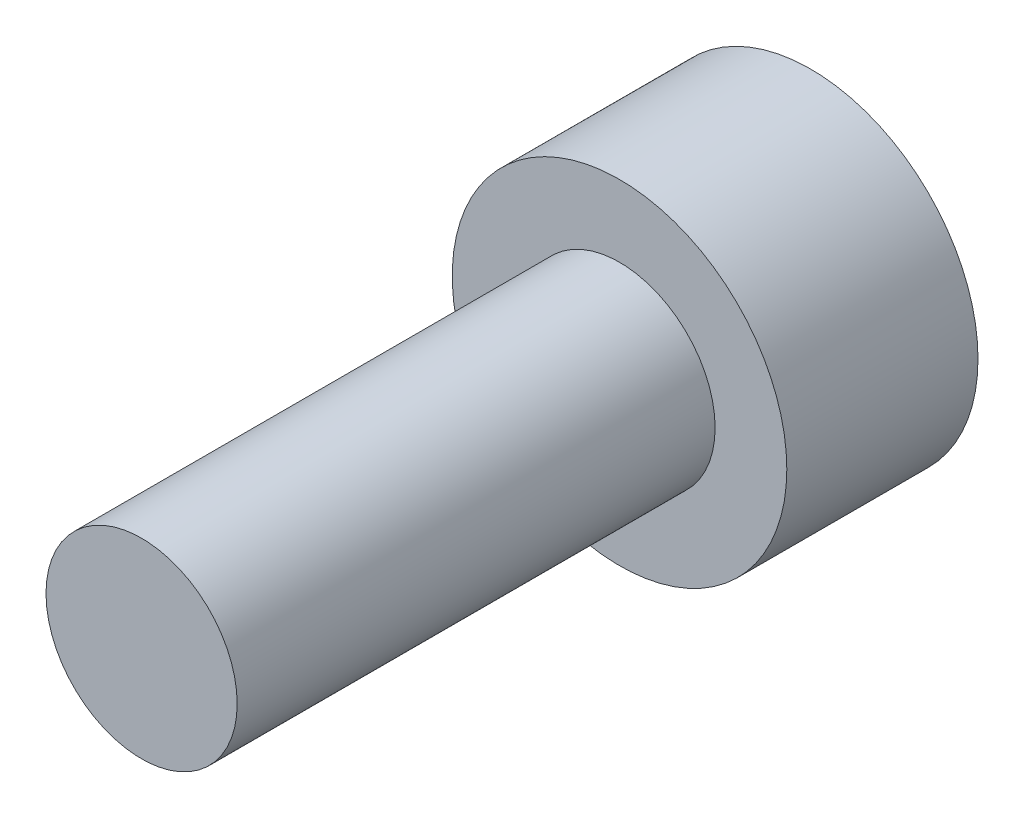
ISO-10303-21;
HEADER;
FILE_DESCRIPTION(('STEP AP214'),'2;1');
FILE_NAME('part.step','',(''),(''),'','','');
FILE_SCHEMA(('AUTOMOTIVE_DESIGN { 1 0 10303 214 1 1 1 1 }'));
ENDSEC;
DATA;
#1=APPLICATION_CONTEXT('core data for automotive mechanical design processes');
#2=APPLICATION_PROTOCOL_DEFINITION('international standard','automotive_design',2000,#1);
#3=PRODUCT_CONTEXT('',#1,'mechanical');
#4=PRODUCT('Part','Part','',(#3));
#5=PRODUCT_RELATED_PRODUCT_CATEGORY('part','',(#4));
#6=PRODUCT_DEFINITION_FORMATION('','',#4);
#7=PRODUCT_DEFINITION_CONTEXT('part definition',#1,'design');
#8=PRODUCT_DEFINITION('design','',#6,#7);
#9=PRODUCT_DEFINITION_SHAPE('','',#8);
#10=(LENGTH_UNIT() NAMED_UNIT(*) SI_UNIT(.MILLI.,.METRE.));
#11=(NAMED_UNIT(*) PLANE_ANGLE_UNIT() SI_UNIT($,.RADIAN.));
#12=(NAMED_UNIT(*) SI_UNIT($,.STERADIAN.) SOLID_ANGLE_UNIT());
#13=UNCERTAINTY_MEASURE_WITH_UNIT(LENGTH_MEASURE(1.E-05),#10,'distance_accuracy_value','');
#14=(GEOMETRIC_REPRESENTATION_CONTEXT(3) GLOBAL_UNCERTAINTY_ASSIGNED_CONTEXT((#13)) GLOBAL_UNIT_ASSIGNED_CONTEXT((#10,
#11,#12)) REPRESENTATION_CONTEXT('',''));
#15=CARTESIAN_POINT('',(0.,0.,0.));
#16=DIRECTION('',(0.,0.,1.));
#17=DIRECTION('',(1.,0.,0.));
#18=AXIS2_PLACEMENT_3D('',#15,#16,#17);
#19=CARTESIAN_POINT('',(0.,0.,10.));
#20=DIRECTION('',(0.,0.,1.));
#21=DIRECTION('',(1.,0.,0.));
#22=AXIS2_PLACEMENT_3D('',#19,#20,#21);
#23=PLANE('',#22);
#24=CARTESIAN_POINT('',(0.,0.,10.));
#25=DIRECTION('',(0.,0.,1.));
#26=DIRECTION('',(1.,0.,0.));
#27=AXIS2_PLACEMENT_3D('',#24,#25,#26);
#28=CIRCLE('',#27,2.);
#29=CARTESIAN_POINT('',(2.,0.,10.));
#30=VERTEX_POINT('',#29);
#31=EDGE_CURVE('E11',#30,#30,#28,.T.);
#32=ORIENTED_EDGE('',*,*,#31,.T.);
#33=EDGE_LOOP('',(#32));
#34=FACE_BOUND('',#33,.T.);
#35=ADVANCED_FACE('F32',(#34),#23,.T.);
#36=CARTESIAN_POINT('',(0.,0.,10.));
#37=DIRECTION('',(0.,0.,1.));
#38=DIRECTION('',(1.,0.,0.));
#39=AXIS2_PLACEMENT_3D('',#36,#37,#38);
#40=CYLINDRICAL_SURFACE('',#39,2.);
#41=CARTESIAN_POINT('',(0.,0.,0.));
#42=DIRECTION('',(0.,0.,1.));
#43=DIRECTION('',(1.,0.,0.));
#44=AXIS2_PLACEMENT_3D('',#41,#42,#43);
#45=CIRCLE('',#44,2.);
#46=CARTESIAN_POINT('',(2.,0.,0.));
#47=VERTEX_POINT('',#46);
#48=EDGE_CURVE('E39',#47,#47,#45,.T.);
#49=ORIENTED_EDGE('',*,*,#48,.T.);
#50=EDGE_LOOP('',(#49));
#51=FACE_BOUND('',#50,.T.);
#52=ORIENTED_EDGE('',*,*,#31,.F.);
#53=EDGE_LOOP('',(#52));
#54=FACE_BOUND('',#53,.T.);
#55=ADVANCED_FACE('F146',(#51,#54),#40,.T.);
#56=CARTESIAN_POINT('',(0.,-2.,0.));
#57=DIRECTION('',(0.,0.,1.));
#58=DIRECTION('',(1.,0.,0.));
#59=AXIS2_PLACEMENT_3D('',#56,#57,#58);
#60=PLANE('',#59);
#61=CARTESIAN_POINT('',(0.,0.,0.));
#62=DIRECTION('',(0.,0.,1.));
#63=DIRECTION('',(1.,0.,0.));
#64=AXIS2_PLACEMENT_3D('',#61,#62,#63);
#65=CIRCLE('',#64,3.5);
#66=CARTESIAN_POINT('',(3.5,0.,0.));
#67=VERTEX_POINT('',#66);
#68=EDGE_CURVE('E141',#67,#67,#65,.T.);
#69=ORIENTED_EDGE('',*,*,#68,.T.);
#70=EDGE_LOOP('',(#69));
#71=FACE_BOUND('',#70,.T.);
#72=ORIENTED_EDGE('',*,*,#48,.F.);
#73=EDGE_LOOP('',(#72));
#74=FACE_BOUND('',#73,.T.);
#75=ADVANCED_FACE('F149',(#71,#74),#60,.T.);
#76=CARTESIAN_POINT('',(0.,0.,10.));
#77=DIRECTION('',(0.,0.,1.));
#78=DIRECTION('',(1.,0.,0.));
#79=AXIS2_PLACEMENT_3D('',#76,#77,#78);
#80=CYLINDRICAL_SURFACE('',#79,3.5);
#81=CARTESIAN_POINT('',(0.,0.,-4.));
#82=DIRECTION('',(0.,0.,1.));
#83=DIRECTION('',(1.,0.,0.));
#84=AXIS2_PLACEMENT_3D('',#81,#82,#83);
#85=CIRCLE('',#84,3.5);
#86=CARTESIAN_POINT('',(3.5,0.,-4.));
#87=VERTEX_POINT('',#86);
#88=EDGE_CURVE('E133',#87,#87,#85,.T.);
#89=ORIENTED_EDGE('',*,*,#88,.T.);
#90=EDGE_LOOP('',(#89));
#91=FACE_BOUND('',#90,.T.);
#92=ORIENTED_EDGE('',*,*,#68,.F.);
#93=EDGE_LOOP('',(#92));
#94=FACE_BOUND('',#93,.T.);
#95=ADVANCED_FACE('F151',(#91,#94),#80,.T.);
#96=CARTESIAN_POINT('',(0.,-3.5,-4.));
#97=DIRECTION('',(0.,0.,-1.));
#98=DIRECTION('',(-1.,0.,0.));
#99=AXIS2_PLACEMENT_3D('',#96,#97,#98);
#100=PLANE('',#99);
#101=DIRECTION('',(0.866025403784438,-0.5,0.));
#102=VECTOR('',#101,1.);
#103=CARTESIAN_POINT('',(0.,1.73205080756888,-4.));
#104=LINE('',#103,#102);
#105=CARTESIAN_POINT('',(0.,1.73205080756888,-4.));
#106=VERTEX_POINT('',#105);
#107=CARTESIAN_POINT('',(1.5,0.866025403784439,-4.));
#108=VERTEX_POINT('',#107);
#109=EDGE_CURVE('E46',#106,#108,#104,.T.);
#110=ORIENTED_EDGE('',*,*,#109,.F.);
#111=DIRECTION('',(0.866025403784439,0.5,0.));
#112=VECTOR('',#111,1.);
#113=CARTESIAN_POINT('',(-1.5,0.866025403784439,-4.));
#114=LINE('',#113,#112);
#115=CARTESIAN_POINT('',(-1.5,0.866025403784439,-4.));
#116=VERTEX_POINT('',#115);
#117=EDGE_CURVE('E129',#116,#106,#114,.T.);
#118=ORIENTED_EDGE('',*,*,#117,.F.);
#119=DIRECTION('',(0.,1.,0.));
#120=VECTOR('',#119,1.);
#121=CARTESIAN_POINT('',(-1.5,-0.866025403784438,-4.));
#122=LINE('',#121,#120);
#123=CARTESIAN_POINT('',(-1.5,-0.866025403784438,-4.));
#124=VERTEX_POINT('',#123);
#125=EDGE_CURVE('E127',#124,#116,#122,.T.);
#126=ORIENTED_EDGE('',*,*,#125,.F.);
#127=DIRECTION('',(-0.866025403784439,0.5,0.));
#128=VECTOR('',#127,1.);
#129=CARTESIAN_POINT('',(0.,-1.73205080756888,-4.));
#130=LINE('',#129,#128);
#131=CARTESIAN_POINT('',(0.,-1.73205080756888,-4.));
#132=VERTEX_POINT('',#131);
#133=EDGE_CURVE('E94',#132,#124,#130,.T.);
#134=ORIENTED_EDGE('',*,*,#133,.F.);
#135=DIRECTION('',(-0.866025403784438,-0.5,0.));
#136=VECTOR('',#135,1.);
#137=CARTESIAN_POINT('',(1.5,-0.866025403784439,-4.));
#138=LINE('',#137,#136);
#139=CARTESIAN_POINT('',(1.5,-0.866025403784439,-4.));
#140=VERTEX_POINT('',#139);
#141=EDGE_CURVE('E123',#140,#132,#138,.T.);
#142=ORIENTED_EDGE('',*,*,#141,.F.);
#143=DIRECTION('',(0.,-1.,0.));
#144=VECTOR('',#143,1.);
#145=CARTESIAN_POINT('',(1.5,0.866025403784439,-4.));
#146=LINE('',#145,#144);
#147=EDGE_CURVE('E120',#108,#140,#146,.T.);
#148=ORIENTED_EDGE('',*,*,#147,.F.);
#149=EDGE_LOOP('',(#110,#118,#126,#134,#142,#148));
#150=FACE_BOUND('',#149,.T.);
#151=ORIENTED_EDGE('',*,*,#88,.F.);
#152=EDGE_LOOP('',(#151));
#153=FACE_BOUND('',#152,.T.);
#154=ADVANCED_FACE('F158',(#150,#153),#100,.T.);
#155=CARTESIAN_POINT('',(0.,1.73205080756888,-1.));
#156=DIRECTION('',(0.5,0.866025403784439,0.));
#157=DIRECTION('',(-0.866025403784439,0.5,0.));
#158=AXIS2_PLACEMENT_3D('',#155,#156,#157);
#159=PLANE('',#158);
#160=ORIENTED_EDGE('',*,*,#109,.T.);
#161=DIRECTION('',(0.,0.,-1.));
#162=VECTOR('',#161,1.);
#163=CARTESIAN_POINT('',(1.5,0.866025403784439,-1.));
#164=LINE('',#163,#162);
#165=CARTESIAN_POINT('',(1.5,0.866025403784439,-1.));
#166=VERTEX_POINT('',#165);
#167=EDGE_CURVE('E76',#166,#108,#164,.T.);
#168=ORIENTED_EDGE('',*,*,#167,.F.);
#169=DIRECTION('',(0.866025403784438,-0.5,0.));
#170=VECTOR('',#169,1.);
#171=CARTESIAN_POINT('',(0.,1.73205080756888,-1.));
#172=LINE('',#171,#170);
#173=CARTESIAN_POINT('',(0.,1.73205080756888,-1.));
#174=VERTEX_POINT('',#173);
#175=EDGE_CURVE('E131',#174,#166,#172,.T.);
#176=ORIENTED_EDGE('',*,*,#175,.F.);
#177=DIRECTION('',(0.,0.,-1.));
#178=VECTOR('',#177,1.);
#179=CARTESIAN_POINT('',(0.,1.73205080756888,-1.));
#180=LINE('',#179,#178);
#181=EDGE_CURVE('E54',#174,#106,#180,.T.);
#182=ORIENTED_EDGE('',*,*,#181,.T.);
#183=EDGE_LOOP('',(#160,#168,#176,#182));
#184=FACE_BOUND('',#183,.T.);
#185=ADVANCED_FACE('F189',(#184),#159,.F.);
#186=CARTESIAN_POINT('',(-1.5,0.866025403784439,-1.));
#187=DIRECTION('',(-0.5,0.866025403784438,0.));
#188=DIRECTION('',(-0.866025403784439,-0.5,0.));
#189=AXIS2_PLACEMENT_3D('',#186,#187,#188);
#190=PLANE('',#189);
#191=ORIENTED_EDGE('',*,*,#117,.T.);
#192=ORIENTED_EDGE('',*,*,#181,.F.);
#193=DIRECTION('',(0.866025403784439,0.5,0.));
#194=VECTOR('',#193,1.);
#195=CARTESIAN_POINT('',(-1.5,0.866025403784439,-1.));
#196=LINE('',#195,#194);
#197=CARTESIAN_POINT('',(-1.5,0.866025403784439,-1.));
#198=VERTEX_POINT('',#197);
#199=EDGE_CURVE('E106',#198,#174,#196,.T.);
#200=ORIENTED_EDGE('',*,*,#199,.F.);
#201=DIRECTION('',(0.,0.,-1.));
#202=VECTOR('',#201,1.);
#203=CARTESIAN_POINT('',(-1.5,0.866025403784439,-1.));
#204=LINE('',#203,#202);
#205=EDGE_CURVE('E98',#198,#116,#204,.T.);
#206=ORIENTED_EDGE('',*,*,#205,.T.);
#207=EDGE_LOOP('',(#191,#192,#200,#206));
#208=FACE_BOUND('',#207,.T.);
#209=ADVANCED_FACE('F199',(#208),#190,.F.);
#210=CARTESIAN_POINT('',(-1.5,-0.866025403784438,-1.));
#211=DIRECTION('',(-1.,0.,0.));
#212=DIRECTION('',(0.,0.,1.));
#213=AXIS2_PLACEMENT_3D('',#210,#211,#212);
#214=PLANE('',#213);
#215=ORIENTED_EDGE('',*,*,#125,.T.);
#216=ORIENTED_EDGE('',*,*,#205,.F.);
#217=DIRECTION('',(0.,1.,0.));
#218=VECTOR('',#217,1.);
#219=CARTESIAN_POINT('',(-1.5,-0.866025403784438,-1.));
#220=LINE('',#219,#218);
#221=CARTESIAN_POINT('',(-1.5,-0.866025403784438,-1.));
#222=VERTEX_POINT('',#221);
#223=EDGE_CURVE('E102',#222,#198,#220,.T.);
#224=ORIENTED_EDGE('',*,*,#223,.F.);
#225=DIRECTION('',(0.,0.,-1.));
#226=VECTOR('',#225,1.);
#227=CARTESIAN_POINT('',(-1.5,-0.866025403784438,-1.));
#228=LINE('',#227,#226);
#229=EDGE_CURVE('E87',#222,#124,#228,.T.);
#230=ORIENTED_EDGE('',*,*,#229,.T.);
#231=EDGE_LOOP('',(#215,#216,#224,#230));
#232=FACE_BOUND('',#231,.T.);
#233=ADVANCED_FACE('F103',(#232),#214,.F.);
#234=CARTESIAN_POINT('',(0.,-1.73205080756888,-1.));
#235=DIRECTION('',(-0.5,-0.866025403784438,0.));
#236=DIRECTION('',(0.866025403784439,-0.5,0.));
#237=AXIS2_PLACEMENT_3D('',#234,#235,#236);
#238=PLANE('',#237);
#239=ORIENTED_EDGE('',*,*,#133,.T.);
#240=ORIENTED_EDGE('',*,*,#229,.F.);
#241=DIRECTION('',(-0.866025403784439,0.5,0.));
#242=VECTOR('',#241,1.);
#243=CARTESIAN_POINT('',(0.,-1.73205080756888,-1.));
#244=LINE('',#243,#242);
#245=CARTESIAN_POINT('',(0.,-1.73205080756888,-1.));
#246=VERTEX_POINT('',#245);
#247=EDGE_CURVE('E91',#246,#222,#244,.T.);
#248=ORIENTED_EDGE('',*,*,#247,.F.);
#249=DIRECTION('',(0.,0.,-1.));
#250=VECTOR('',#249,1.);
#251=CARTESIAN_POINT('',(0.,-1.73205080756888,-1.));
#252=LINE('',#251,#250);
#253=EDGE_CURVE('E99',#246,#132,#252,.T.);
#254=ORIENTED_EDGE('',*,*,#253,.T.);
#255=EDGE_LOOP('',(#239,#240,#248,#254));
#256=FACE_BOUND('',#255,.T.);
#257=ADVANCED_FACE('F89',(#256),#238,.F.);
#258=CARTESIAN_POINT('',(1.5,-0.866025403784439,-1.));
#259=DIRECTION('',(0.5,-0.866025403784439,0.));
#260=DIRECTION('',(0.866025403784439,0.5,0.));
#261=AXIS2_PLACEMENT_3D('',#258,#259,#260);
#262=PLANE('',#261);
#263=ORIENTED_EDGE('',*,*,#141,.T.);
#264=ORIENTED_EDGE('',*,*,#253,.F.);
#265=DIRECTION('',(-0.866025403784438,-0.5,0.));
#266=VECTOR('',#265,1.);
#267=CARTESIAN_POINT('',(1.5,-0.866025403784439,-1.));
#268=LINE('',#267,#266);
#269=CARTESIAN_POINT('',(1.5,-0.866025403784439,-1.));
#270=VERTEX_POINT('',#269);
#271=EDGE_CURVE('E112',#270,#246,#268,.T.);
#272=ORIENTED_EDGE('',*,*,#271,.F.);
#273=DIRECTION('',(0.,0.,-1.));
#274=VECTOR('',#273,1.);
#275=CARTESIAN_POINT('',(1.5,-0.866025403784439,-1.));
#276=LINE('',#275,#274);
#277=EDGE_CURVE('E136',#270,#140,#276,.T.);
#278=ORIENTED_EDGE('',*,*,#277,.T.);
#279=EDGE_LOOP('',(#263,#264,#272,#278));
#280=FACE_BOUND('',#279,.T.);
#281=ADVANCED_FACE('F224',(#280),#262,.F.);
#282=CARTESIAN_POINT('',(1.5,0.866025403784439,-1.));
#283=DIRECTION('',(1.,0.,0.));
#284=DIRECTION('',(0.,0.,-1.));
#285=AXIS2_PLACEMENT_3D('',#282,#283,#284);
#286=PLANE('',#285);
#287=ORIENTED_EDGE('',*,*,#147,.T.);
#288=ORIENTED_EDGE('',*,*,#277,.F.);
#289=DIRECTION('',(0.,-1.,0.));
#290=VECTOR('',#289,1.);
#291=CARTESIAN_POINT('',(1.5,0.866025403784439,-1.));
#292=LINE('',#291,#290);
#293=EDGE_CURVE('E114',#166,#270,#292,.T.);
#294=ORIENTED_EDGE('',*,*,#293,.F.);
#295=ORIENTED_EDGE('',*,*,#167,.T.);
#296=EDGE_LOOP('',(#287,#288,#294,#295));
#297=FACE_BOUND('',#296,.T.);
#298=ADVANCED_FACE('F233',(#297),#286,.F.);
#299=CARTESIAN_POINT('',(3.,0.,-1.));
#300=DIRECTION('',(0.,0.,-1.));
#301=DIRECTION('',(-1.,0.,0.));
#302=AXIS2_PLACEMENT_3D('',#299,#300,#301);
#303=PLANE('',#302);
#304=ORIENTED_EDGE('',*,*,#175,.T.);
#305=ORIENTED_EDGE('',*,*,#293,.T.);
#306=ORIENTED_EDGE('',*,*,#271,.T.);
#307=ORIENTED_EDGE('',*,*,#247,.T.);
#308=ORIENTED_EDGE('',*,*,#223,.T.);
#309=ORIENTED_EDGE('',*,*,#199,.T.);
#310=EDGE_LOOP('',(#304,#305,#306,#307,#308,#309));
#311=FACE_BOUND('',#310,.T.);
#312=ADVANCED_FACE('F109',(#311),#303,.T.);
#313=CLOSED_SHELL('',(#35,#55,#75,#95,#154,#185,#209,#233,#257,#281,#298,#312));
#314=MANIFOLD_SOLID_BREP('B2',#313);
#315=ADVANCED_BREP_SHAPE_REPRESENTATION('',(#18,#314),#14);
#316=SHAPE_DEFINITION_REPRESENTATION(#9,#315);
ENDSEC;
END-ISO-10303-21;
